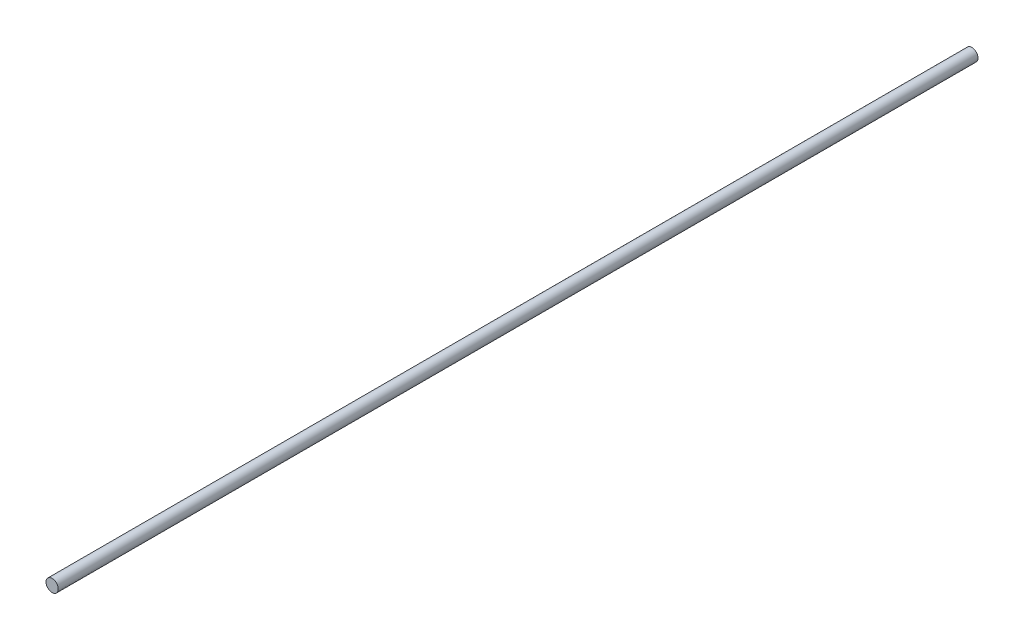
from build123d import *

# Parameters (mm, degrees)
SKETCH1_R           = 3
BOSS_EXTRUDE1_DEPTH = 450


with BuildPart() as part:
    # Sketch1 → Boss-Extrude1 (new body)
    with BuildSketch(Plane.XY):
        Circle(SKETCH1_R)
    extrude(amount=BOSS_EXTRUDE1_DEPTH)


solid = part.part
